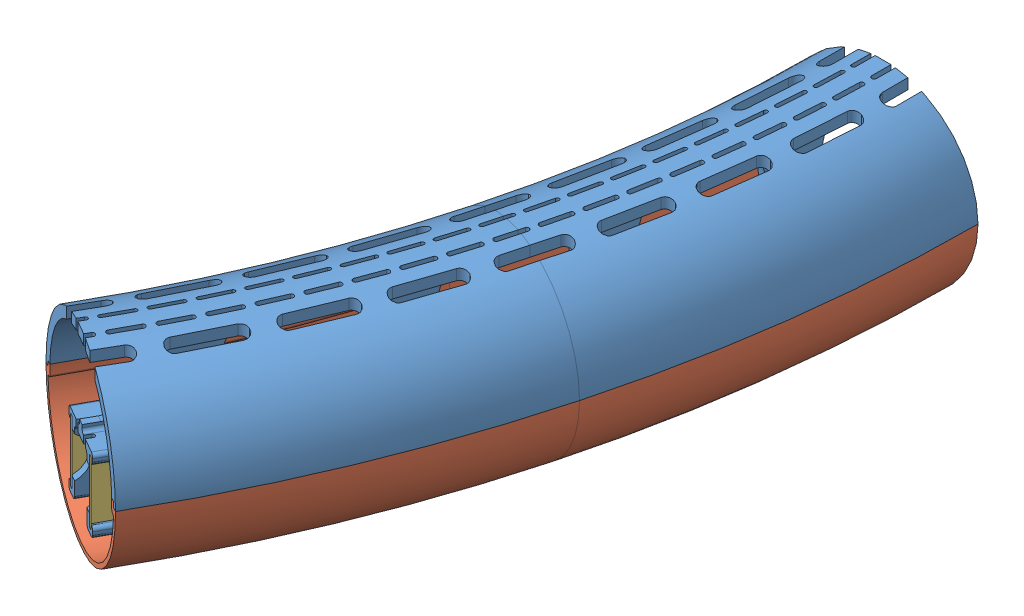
SolidWorks assembly Сборка7.sldasm, configuration По умолчанию (file format 12000). Lengths in mm.
Overall size (57.11 30 110.57).
8 component instances, 3 part files, 2 mates.
Components (placement in the parent):
- big_15-1: big_15.SLDASM [По умолчанию] at (11.0708 3.2405 -12.0861) size (36.3 30 56.86)
  - big_frame-1: big_frame.SLDPRT [По умолчанию] at (-161.077 38.0168 -5.962) size (36.3 25.55 56.86)
  - big_glass-1: big_glass.SLDPRT [По умолчанию] at (-161.077 38.0168 -5.962) size (36.3 15.78 55.65)
  - big_led-1: big_led.SLDPRT [По умолчанию] at (-161.077 38.0168 -5.962) size (15.37 10 52.89)
- big_15-2: big_15.SLDASM [По умолчанию] at (4.0391 3.2405 29.4006) x (0.965926 0 0.258819) z (-0.258819 0 0.965926) size (36.3 30 56.86)
  - big_frame-1: big_frame.SLDPRT [По умолчанию] at (-161.077 38.0168 -5.962) size (36.3 25.55 56.86)
  - big_glass-1: big_glass.SLDPRT [По умолчанию] at (-161.077 38.0168 -5.962) size (36.3 15.78 55.65)
  - big_led-1: big_led.SLDPRT [По умолчанию] at (-161.077 38.0168 -5.962) size (15.37 10 52.89)
Mates (geometry in assembly coordinates):
- Совпадение1: coincident aligned: circle of big_15-1/big_frame-1; circle of big_15-2/big_frame-1
- Совпадение2: coincident: point of big_15-1/big_frame-1; point of big_15-2/big_frame-1
